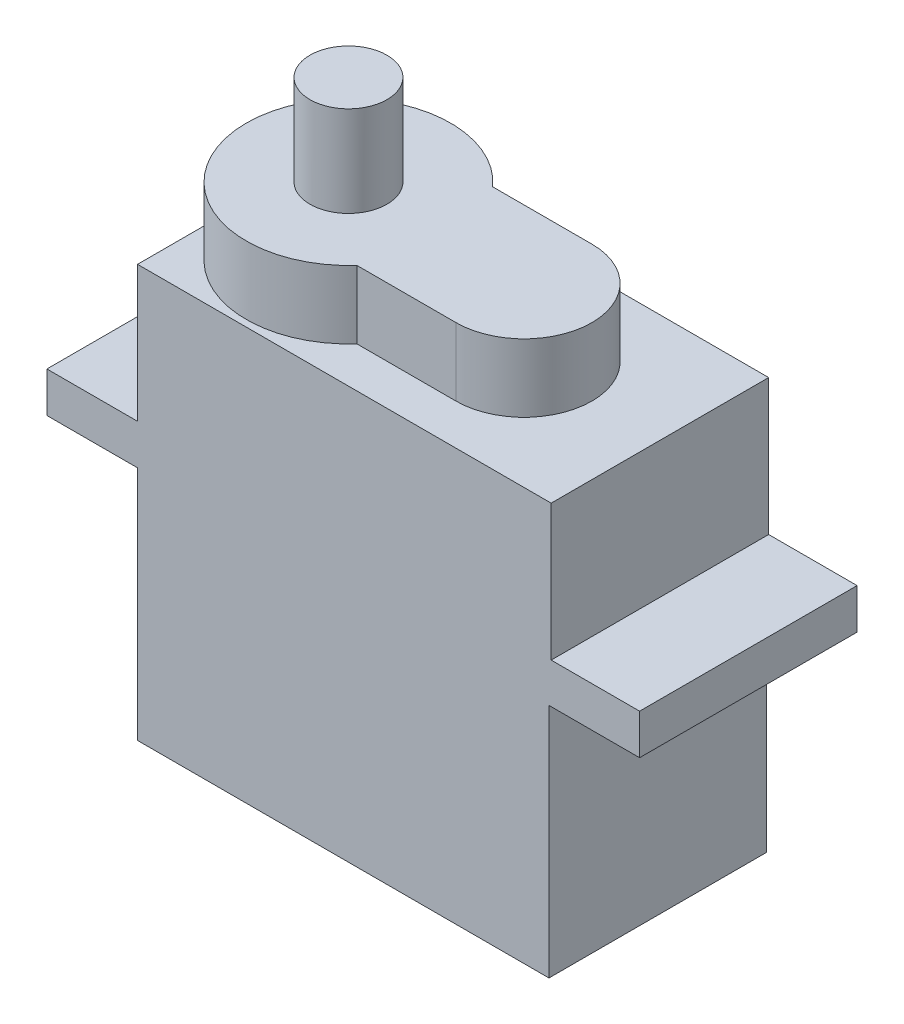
from build123d import *

# Parameters (mm, degrees)
BOSS_EXTRUDE1_DEPTH = 12.192
BOSS_EXTRUDE2_DEPTH = 3.81
SKETCH3_R           = 2.159
BOSS_EXTRUDE3_DEPTH = 5.08


with BuildPart() as part:
    # Sketch1 → Boss-Extrude1 (new body)
    with BuildSketch(Plane.XY):
        Polygon((-11.5316, 9.8806), (11.654734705, 9.8806), (11.654734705, 2.2606), (16.6116, 2.2606), (16.6116, 0), (11.5316, 0), (11.5316, -13.2334), (-11.5316, -13.2334), (-11.5316, 0), (-16.6116, 0), (-16.6116, 2.2606), (-11.5316, 2.2606), align=None)
    extrude(amount=BOSS_EXTRUDE1_DEPTH)

    # Sketch2 → Boss-Extrude2 (add)
    with BuildSketch(Plane(origin=(0, 9.8806, 0), x_dir=(1, 0, 0), z_dir=(0, 1, 0))):
        with BuildLine():
            Line((4.034734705, -2.286), (-1.52716675, -2.286))
            ThreePointArc((-1.52716675, -2.286), (-11.5316, -6.096), (-1.52716675, -9.906))
            Line((-1.52716675, -9.906), (4.034734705, -9.906))
            ThreePointArc((4.034734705, -9.906), (7.844734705, -6.096), (4.034734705, -2.286))
        make_face()
    extrude(amount=BOSS_EXTRUDE2_DEPTH)

    # Sketch3 → Boss-Extrude3 (add)
    with BuildSketch(Plane(origin=(0, 13.6906, 0), x_dir=(1, 0, 0), z_dir=(0, 1, 0))):
        with Locations(Location((-5.8039, -6.096, 0), (0, 0, 90))):
            Circle(SKETCH3_R)
    extrude(amount=BOSS_EXTRUDE3_DEPTH)


solid = part.part
